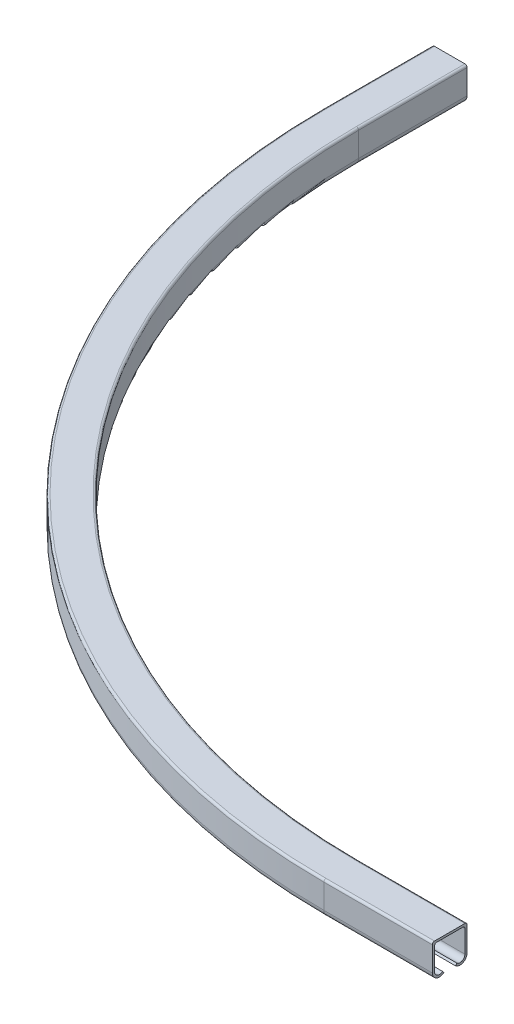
ISO-10303-21;
HEADER;
FILE_DESCRIPTION(('STEP AP214'),'2;1');
FILE_NAME('part.step','',(''),(''),'','','');
FILE_SCHEMA(('AUTOMOTIVE_DESIGN { 1 0 10303 214 1 1 1 1 }'));
ENDSEC;
DATA;
#1=APPLICATION_CONTEXT('core data for automotive mechanical design processes');
#2=APPLICATION_PROTOCOL_DEFINITION('international standard','automotive_design',2000,#1);
#3=PRODUCT_CONTEXT('',#1,'mechanical');
#4=PRODUCT('Part','Part','',(#3));
#5=PRODUCT_RELATED_PRODUCT_CATEGORY('part','',(#4));
#6=PRODUCT_DEFINITION_FORMATION('','',#4);
#7=PRODUCT_DEFINITION_CONTEXT('part definition',#1,'design');
#8=PRODUCT_DEFINITION('design','',#6,#7);
#9=PRODUCT_DEFINITION_SHAPE('','',#8);
#10=(LENGTH_UNIT() NAMED_UNIT(*) SI_UNIT(.MILLI.,.METRE.));
#11=(NAMED_UNIT(*) PLANE_ANGLE_UNIT() SI_UNIT($,.RADIAN.));
#12=(NAMED_UNIT(*) SI_UNIT($,.STERADIAN.) SOLID_ANGLE_UNIT());
#13=UNCERTAINTY_MEASURE_WITH_UNIT(LENGTH_MEASURE(1.E-05),#10,'distance_accuracy_value','');
#14=(GEOMETRIC_REPRESENTATION_CONTEXT(3) GLOBAL_UNCERTAINTY_ASSIGNED_CONTEXT((#13)) GLOBAL_UNIT_ASSIGNED_CONTEXT((#10,
#11,#12)) REPRESENTATION_CONTEXT('',''));
#15=CARTESIAN_POINT('',(0.,0.,0.));
#16=DIRECTION('',(0.,0.,1.));
#17=DIRECTION('',(1.,0.,0.));
#18=AXIS2_PLACEMENT_3D('',#15,#16,#17);
#19=CARTESIAN_POINT('',(600.,-24.5,609.5));
#20=DIRECTION('',(1.,0.,0.));
#21=DIRECTION('',(0.,0.,-1.));
#22=AXIS2_PLACEMENT_3D('',#19,#20,#21);
#23=CYLINDRICAL_SURFACE('',#22,6.5);
#24=CARTESIAN_POINT('',(600.,-24.5,609.5));
#25=DIRECTION('',(1.,0.,0.));
#26=DIRECTION('',(0.,0.,-1.));
#27=AXIS2_PLACEMENT_3D('',#24,#25,#26);
#28=CIRCLE('',#27,6.5);
#29=CARTESIAN_POINT('',(600.,-24.5,616.));
#30=VERTEX_POINT('',#29);
#31=CARTESIAN_POINT('',(600.,-29.460846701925,605.3));
#32=VERTEX_POINT('',#31);
#33=EDGE_CURVE('E268',#30,#32,#28,.T.);
#34=ORIENTED_EDGE('',*,*,#33,.T.);
#35=DIRECTION('',(1.,0.,0.));
#36=VECTOR('',#35,1.);
#37=CARTESIAN_POINT('',(600.,-29.460846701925,605.3));
#38=LINE('',#37,#36);
#39=CARTESIAN_POINT('',(700.,-29.460846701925,605.3));
#40=VERTEX_POINT('',#39);
#41=EDGE_CURVE('E385',#32,#40,#38,.T.);
#42=ORIENTED_EDGE('',*,*,#41,.T.);
#43=CARTESIAN_POINT('',(700.,-24.5,609.5));
#44=DIRECTION('',(1.,0.,0.));
#45=DIRECTION('',(0.,0.,-1.));
#46=AXIS2_PLACEMENT_3D('',#43,#44,#45);
#47=CIRCLE('',#46,6.5);
#48=CARTESIAN_POINT('',(700.,-24.5,616.));
#49=VERTEX_POINT('',#48);
#50=EDGE_CURVE('E364',#49,#40,#47,.T.);
#51=ORIENTED_EDGE('',*,*,#50,.F.);
#52=DIRECTION('',(1.,0.,0.));
#53=VECTOR('',#52,1.);
#54=CARTESIAN_POINT('',(600.,-24.5,616.));
#55=LINE('',#54,#53);
#56=EDGE_CURVE('E388',#30,#49,#55,.T.);
#57=ORIENTED_EDGE('',*,*,#56,.F.);
#58=EDGE_LOOP('',(#34,#42,#51,#57));
#59=FACE_BOUND('',#58,.T.);
#60=ADVANCED_FACE('F33',(#59),#23,.T.);
#61=CARTESIAN_POINT('',(600.,-27.9344323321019,606.592307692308));
#62=DIRECTION('',(0.,0.646153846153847,-0.763207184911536));
#63=DIRECTION('',(0.,0.763207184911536,0.646153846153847));
#64=AXIS2_PLACEMENT_3D('',#61,#62,#63);
#65=PLANE('',#64);
#66=DIRECTION('',(0.,0.763207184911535,0.646153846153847));
#67=VECTOR('',#66,1.);
#68=CARTESIAN_POINT('',(600.,-27.9344323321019,606.592307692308));
#69=LINE('',#68,#67);
#70=CARTESIAN_POINT('',(600.,-27.9344323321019,606.592307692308));
#71=VERTEX_POINT('',#70);
#72=EDGE_CURVE('E311',#32,#71,#69,.T.);
#73=ORIENTED_EDGE('',*,*,#72,.T.);
#74=DIRECTION('',(1.,0.,0.));
#75=VECTOR('',#74,1.);
#76=CARTESIAN_POINT('',(600.,-27.9344323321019,606.592307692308));
#77=LINE('',#76,#75);
#78=CARTESIAN_POINT('',(700.,-27.9344323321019,606.592307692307));
#79=VERTEX_POINT('',#78);
#80=EDGE_CURVE('E382',#71,#79,#77,.T.);
#81=ORIENTED_EDGE('',*,*,#80,.T.);
#82=DIRECTION('',(0.,0.763207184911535,0.646153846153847));
#83=VECTOR('',#82,1.);
#84=CARTESIAN_POINT('',(700.,-27.9344323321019,606.592307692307));
#85=LINE('',#84,#83);
#86=EDGE_CURVE('E361',#40,#79,#85,.T.);
#87=ORIENTED_EDGE('',*,*,#86,.F.);
#88=ORIENTED_EDGE('',*,*,#41,.F.);
#89=EDGE_LOOP('',(#73,#81,#87,#88));
#90=FACE_BOUND('',#89,.T.);
#91=ADVANCED_FACE('F655',(#90),#65,.T.);
#92=CARTESIAN_POINT('',(600.,-24.5,609.5));
#93=DIRECTION('',(1.,0.,0.));
#94=DIRECTION('',(0.,0.,-1.));
#95=AXIS2_PLACEMENT_3D('',#92,#93,#94);
#96=CYLINDRICAL_SURFACE('',#95,4.5);
#97=CARTESIAN_POINT('',(600.,-24.5,609.5));
#98=DIRECTION('',(-1.,0.,0.));
#99=DIRECTION('',(0.,0.,-1.));
#100=AXIS2_PLACEMENT_3D('',#97,#98,#99);
#101=CIRCLE('',#100,4.5);
#102=CARTESIAN_POINT('',(600.,-24.5,614.));
#103=VERTEX_POINT('',#102);
#104=EDGE_CURVE('E308',#71,#103,#101,.T.);
#105=ORIENTED_EDGE('',*,*,#104,.T.);
#106=DIRECTION('',(1.,0.,0.));
#107=VECTOR('',#106,1.);
#108=CARTESIAN_POINT('',(600.,-24.5,614.));
#109=LINE('',#108,#107);
#110=CARTESIAN_POINT('',(700.,-24.5,614.));
#111=VERTEX_POINT('',#110);
#112=EDGE_CURVE('E379',#103,#111,#109,.T.);
#113=ORIENTED_EDGE('',*,*,#112,.T.);
#114=CARTESIAN_POINT('',(700.,-24.5,609.5));
#115=DIRECTION('',(-1.,0.,0.));
#116=DIRECTION('',(0.,0.,-1.));
#117=AXIS2_PLACEMENT_3D('',#114,#115,#116);
#118=CIRCLE('',#117,4.5);
#119=EDGE_CURVE('E358',#79,#111,#118,.T.);
#120=ORIENTED_EDGE('',*,*,#119,.F.);
#121=ORIENTED_EDGE('',*,*,#80,.F.);
#122=EDGE_LOOP('',(#105,#113,#120,#121));
#123=FACE_BOUND('',#122,.T.);
#124=ADVANCED_FACE('F658',(#123),#96,.F.);
#125=CARTESIAN_POINT('',(600.,-2.,614.));
#126=DIRECTION('',(0.,0.,-1.));
#127=DIRECTION('',(-1.,0.,0.));
#128=AXIS2_PLACEMENT_3D('',#125,#126,#127);
#129=PLANE('',#128);
#130=DIRECTION('',(0.,1.,0.));
#131=VECTOR('',#130,1.);
#132=CARTESIAN_POINT('',(600.,-2.,614.));
#133=LINE('',#132,#131);
#134=CARTESIAN_POINT('',(600.,-4.,614.));
#135=VERTEX_POINT('',#134);
#136=EDGE_CURVE('E305',#103,#135,#133,.T.);
#137=ORIENTED_EDGE('',*,*,#136,.T.);
#138=DIRECTION('',(1.,0.,0.));
#139=VECTOR('',#138,1.);
#140=CARTESIAN_POINT('',(600.,-4.,614.));
#141=LINE('',#140,#139);
#142=CARTESIAN_POINT('',(700.,-4.,614.));
#143=VERTEX_POINT('',#142);
#144=EDGE_CURVE('E406',#135,#143,#141,.T.);
#145=ORIENTED_EDGE('',*,*,#144,.T.);
#146=DIRECTION('',(0.,1.,0.));
#147=VECTOR('',#146,1.);
#148=CARTESIAN_POINT('',(700.,-2.,614.));
#149=LINE('',#148,#147);
#150=EDGE_CURVE('E355',#111,#143,#149,.T.);
#151=ORIENTED_EDGE('',*,*,#150,.F.);
#152=ORIENTED_EDGE('',*,*,#112,.F.);
#153=EDGE_LOOP('',(#137,#145,#151,#152));
#154=FACE_BOUND('',#153,.T.);
#155=ADVANCED_FACE('F584',(#154),#129,.T.);
#156=CARTESIAN_POINT('',(600.,-2.,586.));
#157=DIRECTION('',(0.,0.,1.));
#158=DIRECTION('',(1.,0.,0.));
#159=AXIS2_PLACEMENT_3D('',#156,#157,#158);
#160=PLANE('',#159);
#161=DIRECTION('',(0.,-1.,0.));
#162=VECTOR('',#161,1.);
#163=CARTESIAN_POINT('',(700.,-2.,586.));
#164=LINE('',#163,#162);
#165=CARTESIAN_POINT('',(700.,-4.,586.));
#166=VERTEX_POINT('',#165);
#167=CARTESIAN_POINT('',(700.,-24.5,586.));
#168=VERTEX_POINT('',#167);
#169=EDGE_CURVE('E350',#166,#168,#164,.T.);
#170=ORIENTED_EDGE('',*,*,#169,.F.);
#171=DIRECTION('',(1.,0.,0.));
#172=VECTOR('',#171,1.);
#173=CARTESIAN_POINT('',(600.,-4.,586.));
#174=LINE('',#173,#172);
#175=CARTESIAN_POINT('',(600.,-4.,586.));
#176=VERTEX_POINT('',#175);
#177=EDGE_CURVE('E411',#166,#176,#174,.F.);
#178=ORIENTED_EDGE('',*,*,#177,.T.);
#179=DIRECTION('',(0.,-1.,0.));
#180=VECTOR('',#179,1.);
#181=CARTESIAN_POINT('',(600.,-2.,586.));
#182=LINE('',#181,#180);
#183=CARTESIAN_POINT('',(600.,-24.5,586.));
#184=VERTEX_POINT('',#183);
#185=EDGE_CURVE('E303',#176,#184,#182,.T.);
#186=ORIENTED_EDGE('',*,*,#185,.T.);
#187=DIRECTION('',(1.,0.,0.));
#188=VECTOR('',#187,1.);
#189=CARTESIAN_POINT('',(600.,-24.5,586.));
#190=LINE('',#189,#188);
#191=EDGE_CURVE('E376',#184,#168,#190,.T.);
#192=ORIENTED_EDGE('',*,*,#191,.T.);
#193=EDGE_LOOP('',(#170,#178,#186,#192));
#194=FACE_BOUND('',#193,.T.);
#195=ADVANCED_FACE('F913',(#194),#160,.T.);
#196=CARTESIAN_POINT('',(600.,-24.5,590.5));
#197=DIRECTION('',(1.,0.,0.));
#198=DIRECTION('',(0.,0.,-1.));
#199=AXIS2_PLACEMENT_3D('',#196,#197,#198);
#200=CYLINDRICAL_SURFACE('',#199,4.5);
#201=CARTESIAN_POINT('',(600.,-24.5,590.5));
#202=DIRECTION('',(-1.,0.,0.));
#203=DIRECTION('',(0.,0.,1.));
#204=AXIS2_PLACEMENT_3D('',#201,#202,#203);
#205=CIRCLE('',#204,4.5);
#206=CARTESIAN_POINT('',(600.,-27.9344323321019,593.407692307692));
#207=VERTEX_POINT('',#206);
#208=EDGE_CURVE('E300',#184,#207,#205,.T.);
#209=ORIENTED_EDGE('',*,*,#208,.T.);
#210=DIRECTION('',(1.,0.,0.));
#211=VECTOR('',#210,1.);
#212=CARTESIAN_POINT('',(600.,-27.9344323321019,593.407692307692));
#213=LINE('',#212,#211);
#214=CARTESIAN_POINT('',(700.,-27.9344323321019,593.407692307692));
#215=VERTEX_POINT('',#214);
#216=EDGE_CURVE('E373',#207,#215,#213,.T.);
#217=ORIENTED_EDGE('',*,*,#216,.T.);
#218=CARTESIAN_POINT('',(700.,-24.5,590.5));
#219=DIRECTION('',(-1.,0.,0.));
#220=DIRECTION('',(0.,0.,1.));
#221=AXIS2_PLACEMENT_3D('',#218,#219,#220);
#222=CIRCLE('',#221,4.5);
#223=EDGE_CURVE('E347',#168,#215,#222,.T.);
#224=ORIENTED_EDGE('',*,*,#223,.F.);
#225=ORIENTED_EDGE('',*,*,#191,.F.);
#226=EDGE_LOOP('',(#209,#217,#224,#225));
#227=FACE_BOUND('',#226,.T.);
#228=ADVANCED_FACE('F903',(#227),#200,.F.);
#229=CARTESIAN_POINT('',(600.,-27.9344323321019,593.407692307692));
#230=DIRECTION('',(0.,0.646153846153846,0.763207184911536));
#231=DIRECTION('',(0.,-0.763207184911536,0.646153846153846));
#232=AXIS2_PLACEMENT_3D('',#229,#230,#231);
#233=PLANE('',#232);
#234=DIRECTION('',(0.,-0.763207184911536,0.646153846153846));
#235=VECTOR('',#234,1.);
#236=CARTESIAN_POINT('',(600.,-27.9344323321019,593.407692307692));
#237=LINE('',#236,#235);
#238=CARTESIAN_POINT('',(600.,-29.460846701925,594.7));
#239=VERTEX_POINT('',#238);
#240=EDGE_CURVE('E297',#207,#239,#237,.T.);
#241=ORIENTED_EDGE('',*,*,#240,.T.);
#242=DIRECTION('',(1.,0.,0.));
#243=VECTOR('',#242,1.);
#244=CARTESIAN_POINT('',(600.,-29.460846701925,594.7));
#245=LINE('',#244,#243);
#246=CARTESIAN_POINT('',(700.,-29.460846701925,594.7));
#247=VERTEX_POINT('',#246);
#248=EDGE_CURVE('E370',#239,#247,#245,.T.);
#249=ORIENTED_EDGE('',*,*,#248,.T.);
#250=DIRECTION('',(0.,-0.763207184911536,0.646153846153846));
#251=VECTOR('',#250,1.);
#252=CARTESIAN_POINT('',(700.,-27.9344323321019,593.407692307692));
#253=LINE('',#252,#251);
#254=EDGE_CURVE('E344',#215,#247,#253,.T.);
#255=ORIENTED_EDGE('',*,*,#254,.F.);
#256=ORIENTED_EDGE('',*,*,#216,.F.);
#257=EDGE_LOOP('',(#241,#249,#255,#256));
#258=FACE_BOUND('',#257,.T.);
#259=ADVANCED_FACE('F892',(#258),#233,.T.);
#260=CARTESIAN_POINT('',(600.,-24.5,590.5));
#261=DIRECTION('',(1.,0.,0.));
#262=DIRECTION('',(0.,0.,-1.));
#263=AXIS2_PLACEMENT_3D('',#260,#261,#262);
#264=CYLINDRICAL_SURFACE('',#263,6.5);
#265=CARTESIAN_POINT('',(600.,-24.5,590.5));
#266=DIRECTION('',(1.,0.,0.));
#267=DIRECTION('',(0.,0.,1.));
#268=AXIS2_PLACEMENT_3D('',#265,#266,#267);
#269=CIRCLE('',#268,6.5);
#270=CARTESIAN_POINT('',(600.,-24.5,584.));
#271=VERTEX_POINT('',#270);
#272=EDGE_CURVE('E294',#239,#271,#269,.T.);
#273=ORIENTED_EDGE('',*,*,#272,.T.);
#274=DIRECTION('',(1.,0.,0.));
#275=VECTOR('',#274,1.);
#276=CARTESIAN_POINT('',(600.,-24.5,584.));
#277=LINE('',#276,#275);
#278=CARTESIAN_POINT('',(700.,-24.5,584.));
#279=VERTEX_POINT('',#278);
#280=EDGE_CURVE('E367',#271,#279,#277,.T.);
#281=ORIENTED_EDGE('',*,*,#280,.T.);
#282=CARTESIAN_POINT('',(700.,-24.5,590.5));
#283=DIRECTION('',(1.,0.,0.));
#284=DIRECTION('',(0.,0.,1.));
#285=AXIS2_PLACEMENT_3D('',#282,#283,#284);
#286=CIRCLE('',#285,6.5);
#287=EDGE_CURVE('E341',#247,#279,#286,.T.);
#288=ORIENTED_EDGE('',*,*,#287,.F.);
#289=ORIENTED_EDGE('',*,*,#248,.F.);
#290=EDGE_LOOP('',(#273,#281,#288,#289));
#291=FACE_BOUND('',#290,.T.);
#292=ADVANCED_FACE('F489',(#291),#264,.T.);
#293=CARTESIAN_POINT('',(600.,0.,584.));
#294=DIRECTION('',(0.,0.,-1.));
#295=DIRECTION('',(-1.,0.,0.));
#296=AXIS2_PLACEMENT_3D('',#293,#294,#295);
#297=PLANE('',#296);
#298=DIRECTION('',(0.,1.,0.));
#299=VECTOR('',#298,1.);
#300=CARTESIAN_POINT('',(600.,0.,584.));
#301=LINE('',#300,#299);
#302=CARTESIAN_POINT('',(600.,-2.,584.));
#303=VERTEX_POINT('',#302);
#304=EDGE_CURVE('E287',#271,#303,#301,.T.);
#305=ORIENTED_EDGE('',*,*,#304,.T.);
#306=DIRECTION('',(1.,0.,0.));
#307=VECTOR('',#306,1.);
#308=CARTESIAN_POINT('',(700.,-2.,584.));
#309=LINE('',#308,#307);
#310=CARTESIAN_POINT('',(700.,-2.,584.));
#311=VERTEX_POINT('',#310);
#312=EDGE_CURVE('E439',#303,#311,#309,.T.);
#313=ORIENTED_EDGE('',*,*,#312,.T.);
#314=DIRECTION('',(0.,1.,0.));
#315=VECTOR('',#314,1.);
#316=CARTESIAN_POINT('',(700.,0.,584.));
#317=LINE('',#316,#315);
#318=EDGE_CURVE('E338',#279,#311,#317,.T.);
#319=ORIENTED_EDGE('',*,*,#318,.F.);
#320=ORIENTED_EDGE('',*,*,#280,.F.);
#321=EDGE_LOOP('',(#305,#313,#319,#320));
#322=FACE_BOUND('',#321,.T.);
#323=ADVANCED_FACE('F484',(#322),#297,.T.);
#324=CARTESIAN_POINT('',(600.,0.,616.));
#325=DIRECTION('',(0.,0.,1.));
#326=DIRECTION('',(1.,0.,0.));
#327=AXIS2_PLACEMENT_3D('',#324,#325,#326);
#328=PLANE('',#327);
#329=DIRECTION('',(0.,-1.,0.));
#330=VECTOR('',#329,1.);
#331=CARTESIAN_POINT('',(700.,0.,616.));
#332=LINE('',#331,#330);
#333=CARTESIAN_POINT('',(700.,-2.,616.));
#334=VERTEX_POINT('',#333);
#335=EDGE_CURVE('E269',#334,#49,#332,.T.);
#336=ORIENTED_EDGE('',*,*,#335,.F.);
#337=DIRECTION('',(1.,0.,0.));
#338=VECTOR('',#337,1.);
#339=CARTESIAN_POINT('',(600.,-2.,616.));
#340=LINE('',#339,#338);
#341=CARTESIAN_POINT('',(600.,-2.,616.));
#342=VERTEX_POINT('',#341);
#343=EDGE_CURVE('E436',#334,#342,#340,.F.);
#344=ORIENTED_EDGE('',*,*,#343,.T.);
#345=DIRECTION('',(0.,-1.,0.));
#346=VECTOR('',#345,1.);
#347=CARTESIAN_POINT('',(600.,0.,616.));
#348=LINE('',#347,#346);
#349=EDGE_CURVE('E285',#342,#30,#348,.T.);
#350=ORIENTED_EDGE('',*,*,#349,.T.);
#351=ORIENTED_EDGE('',*,*,#56,.T.);
#352=EDGE_LOOP('',(#336,#344,#350,#351));
#353=FACE_BOUND('',#352,.T.);
#354=ADVANCED_FACE('F650',(#353),#328,.T.);
#355=CARTESIAN_POINT('',(600.,-24.5,0.));
#356=DIRECTION('',(0.,1.,0.));
#357=DIRECTION('',(0.,0.,1.));
#358=AXIS2_PLACEMENT_3D('',#355,#356,#357);
#359=TOROIDAL_SURFACE('',#358,609.5,6.5);
#360=CARTESIAN_POINT('',(-9.5,-24.5,0.));
#361=DIRECTION('',(0.,0.,1.));
#362=DIRECTION('',(1.,0.,0.));
#363=AXIS2_PLACEMENT_3D('',#360,#361,#362);
#364=CIRCLE('',#363,6.5);
#365=CARTESIAN_POINT('',(-16.,-24.5,0.));
#366=VERTEX_POINT('',#365);
#367=CARTESIAN_POINT('',(-5.3,-29.460846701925,0.));
#368=VERTEX_POINT('',#367);
#369=EDGE_CURVE('E257',#366,#368,#364,.T.);
#370=ORIENTED_EDGE('',*,*,#369,.T.);
#371=CARTESIAN_POINT('',(600.,-29.460846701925,0.));
#372=DIRECTION('',(0.,1.,0.));
#373=DIRECTION('',(0.,0.,1.));
#374=AXIS2_PLACEMENT_3D('',#371,#372,#373);
#375=CIRCLE('',#374,605.3);
#376=EDGE_CURVE('E270',#368,#32,#375,.T.);
#377=ORIENTED_EDGE('',*,*,#376,.T.);
#378=ORIENTED_EDGE('',*,*,#33,.F.);
#379=CARTESIAN_POINT('',(600.,-24.5,0.));
#380=DIRECTION('',(0.,1.,0.));
#381=DIRECTION('',(0.,0.,1.));
#382=AXIS2_PLACEMENT_3D('',#379,#380,#381);
#383=CIRCLE('',#382,616.);
#384=EDGE_CURVE('E250',#366,#30,#383,.T.);
#385=ORIENTED_EDGE('',*,*,#384,.F.);
#386=EDGE_LOOP('',(#370,#377,#378,#385));
#387=FACE_BOUND('',#386,.T.);
#388=ADVANCED_FACE('F264',(#387),#359,.T.);
#389=CARTESIAN_POINT('',(600.,-29.460846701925,0.));
#390=DIRECTION('',(0.,1.,0.));
#391=DIRECTION('',(0.,0.,1.));
#392=AXIS2_PLACEMENT_3D('',#389,#390,#391);
#393=CONICAL_SURFACE('',#392,605.3,0.702534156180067);
#394=DIRECTION('',(-0.646153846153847,0.763207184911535,0.));
#395=VECTOR('',#394,1.);
#396=CARTESIAN_POINT('',(-6.59230769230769,-27.9344323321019,0.));
#397=LINE('',#396,#395);
#398=CARTESIAN_POINT('',(-6.59230769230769,-27.9344323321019,0.));
#399=VERTEX_POINT('',#398);
#400=EDGE_CURVE('E279',#368,#399,#397,.T.);
#401=ORIENTED_EDGE('',*,*,#400,.T.);
#402=CARTESIAN_POINT('',(600.,-27.9344323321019,0.));
#403=DIRECTION('',(0.,1.,0.));
#404=DIRECTION('',(0.,0.,1.));
#405=AXIS2_PLACEMENT_3D('',#402,#403,#404);
#406=CIRCLE('',#405,606.592307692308);
#407=EDGE_CURVE('E330',#399,#71,#406,.T.);
#408=ORIENTED_EDGE('',*,*,#407,.T.);
#409=ORIENTED_EDGE('',*,*,#72,.F.);
#410=ORIENTED_EDGE('',*,*,#376,.F.);
#411=EDGE_LOOP('',(#401,#408,#409,#410));
#412=FACE_BOUND('',#411,.T.);
#413=ADVANCED_FACE('F663',(#412),#393,.F.);
#414=CARTESIAN_POINT('',(600.,-24.5,0.));
#415=DIRECTION('',(0.,1.,0.));
#416=DIRECTION('',(0.,0.,1.));
#417=AXIS2_PLACEMENT_3D('',#414,#415,#416);
#418=TOROIDAL_SURFACE('',#417,609.5,4.5);
#419=CARTESIAN_POINT('',(-9.5,-24.5,0.));
#420=DIRECTION('',(0.,0.,-1.));
#421=DIRECTION('',(1.,0.,0.));
#422=AXIS2_PLACEMENT_3D('',#419,#420,#421);
#423=CIRCLE('',#422,4.5);
#424=CARTESIAN_POINT('',(-14.,-24.5,0.));
#425=VERTEX_POINT('',#424);
#426=EDGE_CURVE('E557',#399,#425,#423,.T.);
#427=ORIENTED_EDGE('',*,*,#426,.T.);
#428=CARTESIAN_POINT('',(600.,-24.5,0.));
#429=DIRECTION('',(0.,1.,0.));
#430=DIRECTION('',(0.,0.,1.));
#431=AXIS2_PLACEMENT_3D('',#428,#429,#430);
#432=CIRCLE('',#431,614.);
#433=EDGE_CURVE('E327',#425,#103,#432,.T.);
#434=ORIENTED_EDGE('',*,*,#433,.T.);
#435=ORIENTED_EDGE('',*,*,#104,.F.);
#436=ORIENTED_EDGE('',*,*,#407,.F.);
#437=EDGE_LOOP('',(#427,#434,#435,#436));
#438=FACE_BOUND('',#437,.T.);
#439=ADVANCED_FACE('F660',(#438),#418,.F.);
#440=CARTESIAN_POINT('',(600.,0.,0.));
#441=DIRECTION('',(0.,1.,0.));
#442=DIRECTION('',(0.,0.,1.));
#443=AXIS2_PLACEMENT_3D('',#440,#441,#442);
#444=CYLINDRICAL_SURFACE('',#443,614.);
#445=DIRECTION('',(0.,1.,0.));
#446=VECTOR('',#445,1.);
#447=CARTESIAN_POINT('',(-14.,-2.,0.));
#448=LINE('',#447,#446);
#449=CARTESIAN_POINT('',(-14.,-4.,0.));
#450=VERTEX_POINT('',#449);
#451=EDGE_CURVE('E581',#425,#450,#448,.T.);
#452=ORIENTED_EDGE('',*,*,#451,.T.);
#453=CARTESIAN_POINT('',(600.,-4.,0.));
#454=DIRECTION('',(0.,1.,0.));
#455=DIRECTION('',(0.,0.,1.));
#456=AXIS2_PLACEMENT_3D('',#453,#454,#455);
#457=CIRCLE('',#456,614.);
#458=EDGE_CURVE('E441',#450,#135,#457,.T.);
#459=ORIENTED_EDGE('',*,*,#458,.T.);
#460=ORIENTED_EDGE('',*,*,#136,.F.);
#461=ORIENTED_EDGE('',*,*,#433,.F.);
#462=EDGE_LOOP('',(#452,#459,#460,#461));
#463=FACE_BOUND('',#462,.T.);
#464=ADVANCED_FACE('F580',(#463),#444,.F.);
#465=CARTESIAN_POINT('',(600.,0.,0.));
#466=DIRECTION('',(0.,1.,0.));
#467=DIRECTION('',(0.,0.,1.));
#468=AXIS2_PLACEMENT_3D('',#465,#466,#467);
#469=CYLINDRICAL_SURFACE('',#468,586.);
#470=ORIENTED_EDGE('',*,*,#185,.F.);
#471=CARTESIAN_POINT('',(600.,-4.,0.));
#472=DIRECTION('',(0.,1.,0.));
#473=DIRECTION('',(0.,0.,1.));
#474=AXIS2_PLACEMENT_3D('',#471,#472,#473);
#475=CIRCLE('',#474,586.);
#476=CARTESIAN_POINT('',(14.,-4.,0.));
#477=VERTEX_POINT('',#476);
#478=EDGE_CURVE('E443',#176,#477,#475,.F.);
#479=ORIENTED_EDGE('',*,*,#478,.T.);
#480=DIRECTION('',(0.,-1.,0.));
#481=VECTOR('',#480,1.);
#482=CARTESIAN_POINT('',(14.,-2.,0.));
#483=LINE('',#482,#481);
#484=CARTESIAN_POINT('',(14.,-24.5,0.));
#485=VERTEX_POINT('',#484);
#486=EDGE_CURVE('E608',#477,#485,#483,.T.);
#487=ORIENTED_EDGE('',*,*,#486,.T.);
#488=CARTESIAN_POINT('',(600.,-24.5,0.));
#489=DIRECTION('',(0.,1.,0.));
#490=DIRECTION('',(0.,0.,1.));
#491=AXIS2_PLACEMENT_3D('',#488,#489,#490);
#492=CIRCLE('',#491,586.);
#493=EDGE_CURVE('E324',#485,#184,#492,.T.);
#494=ORIENTED_EDGE('',*,*,#493,.T.);
#495=EDGE_LOOP('',(#470,#479,#487,#494));
#496=FACE_BOUND('',#495,.T.);
#497=ADVANCED_FACE('F607',(#496),#469,.T.);
#498=CARTESIAN_POINT('',(600.,-24.5,0.));
#499=DIRECTION('',(0.,1.,0.));
#500=DIRECTION('',(0.,0.,1.));
#501=AXIS2_PLACEMENT_3D('',#498,#499,#500);
#502=TOROIDAL_SURFACE('',#501,590.5,4.5);
#503=CARTESIAN_POINT('',(9.5,-24.5,0.));
#504=DIRECTION('',(0.,0.,-1.));
#505=DIRECTION('',(-1.,0.,0.));
#506=AXIS2_PLACEMENT_3D('',#503,#504,#505);
#507=CIRCLE('',#506,4.5);
#508=CARTESIAN_POINT('',(6.59230769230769,-27.9344323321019,0.));
#509=VERTEX_POINT('',#508);
#510=EDGE_CURVE('E615',#485,#509,#507,.T.);
#511=ORIENTED_EDGE('',*,*,#510,.T.);
#512=CARTESIAN_POINT('',(600.,-27.9344323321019,0.));
#513=DIRECTION('',(0.,1.,0.));
#514=DIRECTION('',(0.,0.,1.));
#515=AXIS2_PLACEMENT_3D('',#512,#513,#514);
#516=CIRCLE('',#515,593.407692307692);
#517=EDGE_CURVE('E321',#509,#207,#516,.T.);
#518=ORIENTED_EDGE('',*,*,#517,.T.);
#519=ORIENTED_EDGE('',*,*,#208,.F.);
#520=ORIENTED_EDGE('',*,*,#493,.F.);
#521=EDGE_LOOP('',(#511,#518,#519,#520));
#522=FACE_BOUND('',#521,.T.);
#523=ADVANCED_FACE('F844',(#522),#502,.F.);
#524=CARTESIAN_POINT('',(600.,-27.9344323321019,0.));
#525=DIRECTION('',(0.,-1.,0.));
#526=DIRECTION('',(0.,0.,-1.));
#527=AXIS2_PLACEMENT_3D('',#524,#525,#526);
#528=CONICAL_SURFACE('',#527,593.407692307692,0.702534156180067);
#529=DIRECTION('',(-0.646153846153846,-0.763207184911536,0.));
#530=VECTOR('',#529,1.);
#531=CARTESIAN_POINT('',(6.59230769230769,-27.9344323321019,0.));
#532=LINE('',#531,#530);
#533=CARTESIAN_POINT('',(5.3,-29.460846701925,0.));
#534=VERTEX_POINT('',#533);
#535=EDGE_CURVE('E502',#509,#534,#532,.T.);
#536=ORIENTED_EDGE('',*,*,#535,.T.);
#537=CARTESIAN_POINT('',(600.,-29.460846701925,0.));
#538=DIRECTION('',(0.,1.,0.));
#539=DIRECTION('',(0.,0.,1.));
#540=AXIS2_PLACEMENT_3D('',#537,#538,#539);
#541=CIRCLE('',#540,594.7);
#542=EDGE_CURVE('E318',#534,#239,#541,.T.);
#543=ORIENTED_EDGE('',*,*,#542,.T.);
#544=ORIENTED_EDGE('',*,*,#240,.F.);
#545=ORIENTED_EDGE('',*,*,#517,.F.);
#546=EDGE_LOOP('',(#536,#543,#544,#545));
#547=FACE_BOUND('',#546,.T.);
#548=ADVANCED_FACE('F624',(#547),#528,.T.);
#549=CARTESIAN_POINT('',(600.,-24.5,0.));
#550=DIRECTION('',(0.,1.,0.));
#551=DIRECTION('',(0.,0.,1.));
#552=AXIS2_PLACEMENT_3D('',#549,#550,#551);
#553=TOROIDAL_SURFACE('',#552,590.5,6.5);
#554=CARTESIAN_POINT('',(9.5,-24.5,0.));
#555=DIRECTION('',(0.,0.,1.));
#556=DIRECTION('',(-1.,0.,0.));
#557=AXIS2_PLACEMENT_3D('',#554,#555,#556);
#558=CIRCLE('',#557,6.5);
#559=CARTESIAN_POINT('',(16.,-24.5,0.));
#560=VERTEX_POINT('',#559);
#561=EDGE_CURVE('E496',#534,#560,#558,.T.);
#562=ORIENTED_EDGE('',*,*,#561,.T.);
#563=CARTESIAN_POINT('',(600.,-24.5,0.));
#564=DIRECTION('',(0.,1.,0.));
#565=DIRECTION('',(0.,0.,1.));
#566=AXIS2_PLACEMENT_3D('',#563,#564,#565);
#567=CIRCLE('',#566,584.);
#568=EDGE_CURVE('E315',#560,#271,#567,.T.);
#569=ORIENTED_EDGE('',*,*,#568,.T.);
#570=ORIENTED_EDGE('',*,*,#272,.F.);
#571=ORIENTED_EDGE('',*,*,#542,.F.);
#572=EDGE_LOOP('',(#562,#569,#570,#571));
#573=FACE_BOUND('',#572,.T.);
#574=ADVANCED_FACE('F494',(#573),#553,.T.);
#575=CARTESIAN_POINT('',(600.,0.,0.));
#576=DIRECTION('',(0.,1.,0.));
#577=DIRECTION('',(0.,0.,1.));
#578=AXIS2_PLACEMENT_3D('',#575,#576,#577);
#579=CYLINDRICAL_SURFACE('',#578,584.);
#580=DIRECTION('',(0.,1.,0.));
#581=VECTOR('',#580,1.);
#582=CARTESIAN_POINT('',(16.,0.,0.));
#583=LINE('',#582,#581);
#584=CARTESIAN_POINT('',(16.,-2.,0.));
#585=VERTEX_POINT('',#584);
#586=EDGE_CURVE('E501',#560,#585,#583,.T.);
#587=ORIENTED_EDGE('',*,*,#586,.T.);
#588=CARTESIAN_POINT('',(600.,-2.,0.));
#589=DIRECTION('',(0.,-1.,0.));
#590=DIRECTION('',(0.,0.,-1.));
#591=AXIS2_PLACEMENT_3D('',#588,#589,#590);
#592=CIRCLE('',#591,584.);
#593=EDGE_CURVE('E50',#585,#303,#592,.F.);
#594=ORIENTED_EDGE('',*,*,#593,.T.);
#595=ORIENTED_EDGE('',*,*,#304,.F.);
#596=ORIENTED_EDGE('',*,*,#568,.F.);
#597=EDGE_LOOP('',(#587,#594,#595,#596));
#598=FACE_BOUND('',#597,.T.);
#599=ADVANCED_FACE('F492',(#598),#579,.F.);
#600=CARTESIAN_POINT('',(600.,0.,0.));
#601=DIRECTION('',(0.,1.,0.));
#602=DIRECTION('',(0.,0.,1.));
#603=AXIS2_PLACEMENT_3D('',#600,#601,#602);
#604=CYLINDRICAL_SURFACE('',#603,616.);
#605=ORIENTED_EDGE('',*,*,#349,.F.);
#606=CARTESIAN_POINT('',(600.,-2.,0.));
#607=DIRECTION('',(0.,-1.,0.));
#608=DIRECTION('',(0.,0.,-1.));
#609=AXIS2_PLACEMENT_3D('',#606,#607,#608);
#610=CIRCLE('',#609,616.);
#611=CARTESIAN_POINT('',(-16.,-2.,0.));
#612=VERTEX_POINT('',#611);
#613=EDGE_CURVE('E252',#342,#612,#610,.T.);
#614=ORIENTED_EDGE('',*,*,#613,.T.);
#615=DIRECTION('',(0.,-1.,0.));
#616=VECTOR('',#615,1.);
#617=CARTESIAN_POINT('',(-16.,0.,0.));
#618=LINE('',#617,#616);
#619=EDGE_CURVE('E246',#612,#366,#618,.T.);
#620=ORIENTED_EDGE('',*,*,#619,.T.);
#621=ORIENTED_EDGE('',*,*,#384,.T.);
#622=EDGE_LOOP('',(#605,#614,#620,#621));
#623=FACE_BOUND('',#622,.T.);
#624=ADVANCED_FACE('F249',(#623),#604,.T.);
#625=CARTESIAN_POINT('',(-16.,0.,0.));
#626=DIRECTION('',(1.,0.,0.));
#627=DIRECTION('',(0.,1.,0.));
#628=AXIS2_PLACEMENT_3D('',#625,#626,#627);
#629=PLANE('',#628);
#630=ORIENTED_EDGE('',*,*,#619,.F.);
#631=DIRECTION('',(0.,0.,-1.));
#632=VECTOR('',#631,1.);
#633=CARTESIAN_POINT('',(-16.,-2.,0.));
#634=LINE('',#633,#632);
#635=CARTESIAN_POINT('',(-16.,-2.,-100.));
#636=VERTEX_POINT('',#635);
#637=EDGE_CURVE('E413',#612,#636,#634,.T.);
#638=ORIENTED_EDGE('',*,*,#637,.T.);
#639=DIRECTION('',(0.,-1.,0.));
#640=VECTOR('',#639,1.);
#641=CARTESIAN_POINT('',(-16.,0.,-100.));
#642=LINE('',#641,#640);
#643=CARTESIAN_POINT('',(-16.,-24.5,-100.));
#644=VERTEX_POINT('',#643);
#645=EDGE_CURVE('E283',#636,#644,#642,.T.);
#646=ORIENTED_EDGE('',*,*,#645,.T.);
#647=DIRECTION('',(0.,0.,-1.));
#648=VECTOR('',#647,1.);
#649=CARTESIAN_POINT('',(-16.,-24.5,0.));
#650=LINE('',#649,#648);
#651=EDGE_CURVE('E275',#366,#644,#650,.T.);
#652=ORIENTED_EDGE('',*,*,#651,.F.);
#653=EDGE_LOOP('',(#630,#638,#646,#652));
#654=FACE_BOUND('',#653,.T.);
#655=ADVANCED_FACE('F281',(#654),#629,.F.);
#656=CARTESIAN_POINT('',(-9.5,-24.5,0.));
#657=DIRECTION('',(0.,0.,-1.));
#658=DIRECTION('',(-1.,0.,0.));
#659=AXIS2_PLACEMENT_3D('',#656,#657,#658);
#660=CYLINDRICAL_SURFACE('',#659,6.5);
#661=CARTESIAN_POINT('',(-9.5,-24.5,-100.));
#662=DIRECTION('',(0.,0.,1.));
#663=DIRECTION('',(1.,0.,0.));
#664=AXIS2_PLACEMENT_3D('',#661,#662,#663);
#665=CIRCLE('',#664,6.5);
#666=CARTESIAN_POINT('',(-5.3,-29.460846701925,-100.));
#667=VERTEX_POINT('',#666);
#668=EDGE_CURVE('E517',#644,#667,#665,.T.);
#669=ORIENTED_EDGE('',*,*,#668,.T.);
#670=DIRECTION('',(0.,0.,-1.));
#671=VECTOR('',#670,1.);
#672=CARTESIAN_POINT('',(-5.3,-29.460846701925,0.));
#673=LINE('',#672,#671);
#674=EDGE_CURVE('E277',#368,#667,#673,.T.);
#675=ORIENTED_EDGE('',*,*,#674,.F.);
#676=ORIENTED_EDGE('',*,*,#369,.F.);
#677=ORIENTED_EDGE('',*,*,#651,.T.);
#678=EDGE_LOOP('',(#669,#675,#676,#677));
#679=FACE_BOUND('',#678,.T.);
#680=ADVANCED_FACE('F274',(#679),#660,.T.);
#681=CARTESIAN_POINT('',(-6.59230769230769,-27.9344323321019,0.));
#682=DIRECTION('',(-0.763207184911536,-0.646153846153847,0.));
#683=DIRECTION('',(0.646153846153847,-0.763207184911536,0.));
#684=AXIS2_PLACEMENT_3D('',#681,#682,#683);
#685=PLANE('',#684);
#686=DIRECTION('',(-0.646153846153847,0.763207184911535,0.));
#687=VECTOR('',#686,1.);
#688=CARTESIAN_POINT('',(-6.59230769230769,-27.9344323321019,-100.));
#689=LINE('',#688,#687);
#690=CARTESIAN_POINT('',(-6.59230769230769,-27.9344323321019,-100.));
#691=VERTEX_POINT('',#690);
#692=EDGE_CURVE('E519',#667,#691,#689,.T.);
#693=ORIENTED_EDGE('',*,*,#692,.T.);
#694=DIRECTION('',(0.,0.,-1.));
#695=VECTOR('',#694,1.);
#696=CARTESIAN_POINT('',(-6.59230769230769,-27.9344323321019,0.));
#697=LINE('',#696,#695);
#698=EDGE_CURVE('E289',#399,#691,#697,.T.);
#699=ORIENTED_EDGE('',*,*,#698,.F.);
#700=ORIENTED_EDGE('',*,*,#400,.F.);
#701=ORIENTED_EDGE('',*,*,#674,.T.);
#702=EDGE_LOOP('',(#693,#699,#700,#701));
#703=FACE_BOUND('',#702,.T.);
#704=ADVANCED_FACE('F665',(#703),#685,.F.);
#705=CARTESIAN_POINT('',(-9.5,-24.5,0.));
#706=DIRECTION('',(0.,0.,-1.));
#707=DIRECTION('',(-1.,0.,0.));
#708=AXIS2_PLACEMENT_3D('',#705,#706,#707);
#709=CYLINDRICAL_SURFACE('',#708,4.5);
#710=CARTESIAN_POINT('',(-9.5,-24.5,-100.));
#711=DIRECTION('',(0.,0.,-1.));
#712=DIRECTION('',(1.,0.,0.));
#713=AXIS2_PLACEMENT_3D('',#710,#711,#712);
#714=CIRCLE('',#713,4.5);
#715=CARTESIAN_POINT('',(-14.,-24.5,-100.));
#716=VERTEX_POINT('',#715);
#717=EDGE_CURVE('E521',#691,#716,#714,.T.);
#718=ORIENTED_EDGE('',*,*,#717,.T.);
#719=DIRECTION('',(0.,0.,-1.));
#720=VECTOR('',#719,1.);
#721=CARTESIAN_POINT('',(-14.,-24.5,0.));
#722=LINE('',#721,#720);
#723=EDGE_CURVE('E547',#425,#716,#722,.T.);
#724=ORIENTED_EDGE('',*,*,#723,.F.);
#725=ORIENTED_EDGE('',*,*,#426,.F.);
#726=ORIENTED_EDGE('',*,*,#698,.T.);
#727=EDGE_LOOP('',(#718,#724,#725,#726));
#728=FACE_BOUND('',#727,.T.);
#729=ADVANCED_FACE('F554',(#728),#709,.F.);
#730=CARTESIAN_POINT('',(-14.,-2.,0.));
#731=DIRECTION('',(-1.,0.,0.));
#732=DIRECTION('',(0.,-1.,0.));
#733=AXIS2_PLACEMENT_3D('',#730,#731,#732);
#734=PLANE('',#733);
#735=DIRECTION('',(0.,1.,0.));
#736=VECTOR('',#735,1.);
#737=CARTESIAN_POINT('',(-14.,-2.,-100.));
#738=LINE('',#737,#736);
#739=CARTESIAN_POINT('',(-14.,-4.,-100.));
#740=VERTEX_POINT('',#739);
#741=EDGE_CURVE('E523',#716,#740,#738,.T.);
#742=ORIENTED_EDGE('',*,*,#741,.T.);
#743=DIRECTION('',(0.,0.,-1.));
#744=VECTOR('',#743,1.);
#745=CARTESIAN_POINT('',(-14.,-4.,0.));
#746=LINE('',#745,#744);
#747=EDGE_CURVE('E404',#740,#450,#746,.F.);
#748=ORIENTED_EDGE('',*,*,#747,.T.);
#749=ORIENTED_EDGE('',*,*,#451,.F.);
#750=ORIENTED_EDGE('',*,*,#723,.T.);
#751=EDGE_LOOP('',(#742,#748,#749,#750));
#752=FACE_BOUND('',#751,.T.);
#753=ADVANCED_FACE('F566',(#752),#734,.F.);
#754=CARTESIAN_POINT('',(0.,-2.,0.));
#755=DIRECTION('',(0.,1.,0.));
#756=DIRECTION('',(0.,0.,1.));
#757=AXIS2_PLACEMENT_3D('',#754,#755,#756);
#758=PLANE('',#757);
#759=CARTESIAN_POINT('',(600.,-2.,0.));
#760=DIRECTION('',(0.,1.,0.));
#761=DIRECTION('',(0.,0.,1.));
#762=AXIS2_PLACEMENT_3D('',#759,#760,#761);
#763=CIRCLE('',#762,612.);
#764=CARTESIAN_POINT('',(600.,-2.,612.));
#765=VERTEX_POINT('',#764);
#766=CARTESIAN_POINT('',(-12.,-2.,0.));
#767=VERTEX_POINT('',#766);
#768=EDGE_CURVE('E397',#765,#767,#763,.F.);
#769=ORIENTED_EDGE('',*,*,#768,.T.);
#770=DIRECTION('',(0.,0.,-1.));
#771=VECTOR('',#770,1.);
#772=CARTESIAN_POINT('',(-12.,-2.,-100.));
#773=LINE('',#772,#771);
#774=CARTESIAN_POINT('',(-12.,-2.,-100.));
#775=VERTEX_POINT('',#774);
#776=EDGE_CURVE('E401',#767,#775,#773,.T.);
#777=ORIENTED_EDGE('',*,*,#776,.T.);
#778=DIRECTION('',(1.,0.,0.));
#779=VECTOR('',#778,1.);
#780=CARTESIAN_POINT('',(0.,-2.,-100.));
#781=LINE('',#780,#779);
#782=CARTESIAN_POINT('',(12.,-2.,-100.));
#783=VERTEX_POINT('',#782);
#784=EDGE_CURVE('E526',#775,#783,#781,.T.);
#785=ORIENTED_EDGE('',*,*,#784,.T.);
#786=DIRECTION('',(0.,0.,-1.));
#787=VECTOR('',#786,1.);
#788=CARTESIAN_POINT('',(12.,-2.,0.));
#789=LINE('',#788,#787);
#790=CARTESIAN_POINT('',(12.,-2.,0.));
#791=VERTEX_POINT('',#790);
#792=EDGE_CURVE('E395',#783,#791,#789,.F.);
#793=ORIENTED_EDGE('',*,*,#792,.T.);
#794=CARTESIAN_POINT('',(600.,-2.,0.));
#795=DIRECTION('',(0.,1.,0.));
#796=DIRECTION('',(0.,0.,1.));
#797=AXIS2_PLACEMENT_3D('',#794,#795,#796);
#798=CIRCLE('',#797,588.);
#799=CARTESIAN_POINT('',(600.,-2.,588.));
#800=VERTEX_POINT('',#799);
#801=EDGE_CURVE('E391',#791,#800,#798,.T.);
#802=ORIENTED_EDGE('',*,*,#801,.T.);
#803=DIRECTION('',(1.,0.,0.));
#804=VECTOR('',#803,1.);
#805=CARTESIAN_POINT('',(1.30562227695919E-12,-2.,588.000000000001));
#806=LINE('',#805,#804);
#807=CARTESIAN_POINT('',(700.,-2.,588.));
#808=VERTEX_POINT('',#807);
#809=EDGE_CURVE('E393',#800,#808,#806,.T.);
#810=ORIENTED_EDGE('',*,*,#809,.T.);
#811=DIRECTION('',(0.,0.,-1.));
#812=VECTOR('',#811,1.);
#813=CARTESIAN_POINT('',(700.,-2.,600.));
#814=LINE('',#813,#812);
#815=CARTESIAN_POINT('',(700.,-2.,612.));
#816=VERTEX_POINT('',#815);
#817=EDGE_CURVE('E352',#816,#808,#814,.T.);
#818=ORIENTED_EDGE('',*,*,#817,.F.);
#819=DIRECTION('',(1.,0.,0.));
#820=VECTOR('',#819,1.);
#821=CARTESIAN_POINT('',(1.35891298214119E-12,-2.,612.000000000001));
#822=LINE('',#821,#820);
#823=EDGE_CURVE('E399',#816,#765,#822,.F.);
#824=ORIENTED_EDGE('',*,*,#823,.T.);
#825=EDGE_LOOP('',(#769,#777,#785,#793,#802,#810,#818,#824));
#826=FACE_BOUND('',#825,.T.);
#827=ADVANCED_FACE('F592',(#826),#758,.F.);
#828=CARTESIAN_POINT('',(14.,-2.,0.));
#829=DIRECTION('',(1.,0.,0.));
#830=DIRECTION('',(0.,1.,0.));
#831=AXIS2_PLACEMENT_3D('',#828,#829,#830);
#832=PLANE('',#831);
#833=ORIENTED_EDGE('',*,*,#486,.F.);
#834=DIRECTION('',(0.,0.,-1.));
#835=VECTOR('',#834,1.);
#836=CARTESIAN_POINT('',(14.,-4.,-100.));
#837=LINE('',#836,#835);
#838=CARTESIAN_POINT('',(14.,-4.,-100.));
#839=VERTEX_POINT('',#838);
#840=EDGE_CURVE('E408',#477,#839,#837,.T.);
#841=ORIENTED_EDGE('',*,*,#840,.T.);
#842=DIRECTION('',(0.,-1.,0.));
#843=VECTOR('',#842,1.);
#844=CARTESIAN_POINT('',(14.,-2.,-100.));
#845=LINE('',#844,#843);
#846=CARTESIAN_POINT('',(14.,-24.5,-100.));
#847=VERTEX_POINT('',#846);
#848=EDGE_CURVE('E529',#839,#847,#845,.T.);
#849=ORIENTED_EDGE('',*,*,#848,.T.);
#850=DIRECTION('',(0.,0.,-1.));
#851=VECTOR('',#850,1.);
#852=CARTESIAN_POINT('',(14.,-24.5,0.));
#853=LINE('',#852,#851);
#854=EDGE_CURVE('E544',#485,#847,#853,.T.);
#855=ORIENTED_EDGE('',*,*,#854,.F.);
#856=EDGE_LOOP('',(#833,#841,#849,#855));
#857=FACE_BOUND('',#856,.T.);
#858=ADVANCED_FACE('F612',(#857),#832,.F.);
#859=CARTESIAN_POINT('',(9.5,-24.5,0.));
#860=DIRECTION('',(0.,0.,-1.));
#861=DIRECTION('',(-1.,0.,0.));
#862=AXIS2_PLACEMENT_3D('',#859,#860,#861);
#863=CYLINDRICAL_SURFACE('',#862,4.5);
#864=CARTESIAN_POINT('',(9.5,-24.5,-100.));
#865=DIRECTION('',(0.,0.,-1.));
#866=DIRECTION('',(-1.,0.,0.));
#867=AXIS2_PLACEMENT_3D('',#864,#865,#866);
#868=CIRCLE('',#867,4.5);
#869=CARTESIAN_POINT('',(6.59230769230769,-27.9344323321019,-100.));
#870=VERTEX_POINT('',#869);
#871=EDGE_CURVE('E531',#847,#870,#868,.T.);
#872=ORIENTED_EDGE('',*,*,#871,.T.);
#873=DIRECTION('',(0.,0.,-1.));
#874=VECTOR('',#873,1.);
#875=CARTESIAN_POINT('',(6.59230769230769,-27.9344323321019,0.));
#876=LINE('',#875,#874);
#877=EDGE_CURVE('E541',#509,#870,#876,.T.);
#878=ORIENTED_EDGE('',*,*,#877,.F.);
#879=ORIENTED_EDGE('',*,*,#510,.F.);
#880=ORIENTED_EDGE('',*,*,#854,.T.);
#881=EDGE_LOOP('',(#872,#878,#879,#880));
#882=FACE_BOUND('',#881,.T.);
#883=ADVANCED_FACE('F783',(#882),#863,.F.);
#884=CARTESIAN_POINT('',(6.59230769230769,-27.9344323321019,0.));
#885=DIRECTION('',(0.763207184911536,-0.646153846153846,0.));
#886=DIRECTION('',(0.646153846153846,0.763207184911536,0.));
#887=AXIS2_PLACEMENT_3D('',#884,#885,#886);
#888=PLANE('',#887);
#889=DIRECTION('',(-0.646153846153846,-0.763207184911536,0.));
#890=VECTOR('',#889,1.);
#891=CARTESIAN_POINT('',(6.59230769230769,-27.9344323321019,-100.));
#892=LINE('',#891,#890);
#893=CARTESIAN_POINT('',(5.3,-29.460846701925,-100.));
#894=VERTEX_POINT('',#893);
#895=EDGE_CURVE('E533',#870,#894,#892,.T.);
#896=ORIENTED_EDGE('',*,*,#895,.T.);
#897=DIRECTION('',(0.,0.,-1.));
#898=VECTOR('',#897,1.);
#899=CARTESIAN_POINT('',(5.3,-29.460846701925,0.));
#900=LINE('',#899,#898);
#901=EDGE_CURVE('E510',#534,#894,#900,.T.);
#902=ORIENTED_EDGE('',*,*,#901,.F.);
#903=ORIENTED_EDGE('',*,*,#535,.F.);
#904=ORIENTED_EDGE('',*,*,#877,.T.);
#905=EDGE_LOOP('',(#896,#902,#903,#904));
#906=FACE_BOUND('',#905,.T.);
#907=ADVANCED_FACE('F627',(#906),#888,.F.);
#908=CARTESIAN_POINT('',(9.5,-24.5,0.));
#909=DIRECTION('',(0.,0.,-1.));
#910=DIRECTION('',(-1.,0.,0.));
#911=AXIS2_PLACEMENT_3D('',#908,#909,#910);
#912=CYLINDRICAL_SURFACE('',#911,6.5);
#913=CARTESIAN_POINT('',(9.5,-24.5,-100.));
#914=DIRECTION('',(0.,0.,1.));
#915=DIRECTION('',(-1.,0.,0.));
#916=AXIS2_PLACEMENT_3D('',#913,#914,#915);
#917=CIRCLE('',#916,6.5);
#918=CARTESIAN_POINT('',(16.,-24.5,-100.));
#919=VERTEX_POINT('',#918);
#920=EDGE_CURVE('E508',#894,#919,#917,.T.);
#921=ORIENTED_EDGE('',*,*,#920,.T.);
#922=DIRECTION('',(0.,0.,-1.));
#923=VECTOR('',#922,1.);
#924=CARTESIAN_POINT('',(16.,-24.5,0.));
#925=LINE('',#924,#923);
#926=EDGE_CURVE('E505',#560,#919,#925,.T.);
#927=ORIENTED_EDGE('',*,*,#926,.F.);
#928=ORIENTED_EDGE('',*,*,#561,.F.);
#929=ORIENTED_EDGE('',*,*,#901,.T.);
#930=EDGE_LOOP('',(#921,#927,#928,#929));
#931=FACE_BOUND('',#930,.T.);
#932=ADVANCED_FACE('F506',(#931),#912,.T.);
#933=CARTESIAN_POINT('',(16.,0.,0.));
#934=DIRECTION('',(-1.,0.,0.));
#935=DIRECTION('',(0.,-1.,0.));
#936=AXIS2_PLACEMENT_3D('',#933,#934,#935);
#937=PLANE('',#936);
#938=DIRECTION('',(0.,1.,0.));
#939=VECTOR('',#938,1.);
#940=CARTESIAN_POINT('',(16.,0.,-100.));
#941=LINE('',#940,#939);
#942=CARTESIAN_POINT('',(16.,-2.,-100.));
#943=VERTEX_POINT('',#942);
#944=EDGE_CURVE('E536',#919,#943,#941,.T.);
#945=ORIENTED_EDGE('',*,*,#944,.T.);
#946=DIRECTION('',(0.,0.,-1.));
#947=VECTOR('',#946,1.);
#948=CARTESIAN_POINT('',(16.,-2.,0.));
#949=LINE('',#948,#947);
#950=EDGE_CURVE('E58',#943,#585,#949,.F.);
#951=ORIENTED_EDGE('',*,*,#950,.T.);
#952=ORIENTED_EDGE('',*,*,#586,.F.);
#953=ORIENTED_EDGE('',*,*,#926,.T.);
#954=EDGE_LOOP('',(#945,#951,#952,#953));
#955=FACE_BOUND('',#954,.T.);
#956=ADVANCED_FACE('F512',(#955),#937,.F.);
#957=CARTESIAN_POINT('',(0.,0.,0.));
#958=DIRECTION('',(0.,-1.,0.));
#959=DIRECTION('',(0.,0.,-1.));
#960=AXIS2_PLACEMENT_3D('',#957,#958,#959);
#961=PLANE('',#960);
#962=DIRECTION('',(-1.,0.,0.));
#963=VECTOR('',#962,1.);
#964=CARTESIAN_POINT('',(0.,0.,-100.));
#965=LINE('',#964,#963);
#966=CARTESIAN_POINT('',(14.,0.,-100.));
#967=VERTEX_POINT('',#966);
#968=CARTESIAN_POINT('',(-14.,0.,-100.));
#969=VERTEX_POINT('',#968);
#970=EDGE_CURVE('E258',#967,#969,#965,.T.);
#971=ORIENTED_EDGE('',*,*,#970,.T.);
#972=DIRECTION('',(0.,0.,-1.));
#973=VECTOR('',#972,1.);
#974=CARTESIAN_POINT('',(-14.,0.,0.));
#975=LINE('',#974,#973);
#976=CARTESIAN_POINT('',(-14.,0.,0.));
#977=VERTEX_POINT('',#976);
#978=EDGE_CURVE('E430',#969,#977,#975,.F.);
#979=ORIENTED_EDGE('',*,*,#978,.T.);
#980=CARTESIAN_POINT('',(600.,0.,0.));
#981=DIRECTION('',(0.,-1.,0.));
#982=DIRECTION('',(0.,0.,-1.));
#983=AXIS2_PLACEMENT_3D('',#980,#981,#982);
#984=CIRCLE('',#983,614.);
#985=CARTESIAN_POINT('',(600.,0.,614.));
#986=VERTEX_POINT('',#985);
#987=EDGE_CURVE('E426',#977,#986,#984,.F.);
#988=ORIENTED_EDGE('',*,*,#987,.T.);
#989=DIRECTION('',(1.,0.,0.));
#990=VECTOR('',#989,1.);
#991=CARTESIAN_POINT('',(700.,0.,614.));
#992=LINE('',#991,#990);
#993=CARTESIAN_POINT('',(700.,0.,614.));
#994=VERTEX_POINT('',#993);
#995=EDGE_CURVE('E428',#986,#994,#992,.T.);
#996=ORIENTED_EDGE('',*,*,#995,.T.);
#997=DIRECTION('',(0.,0.,1.));
#998=VECTOR('',#997,1.);
#999=CARTESIAN_POINT('',(700.,0.,600.));
#1000=LINE('',#999,#998);
#1001=CARTESIAN_POINT('',(700.,0.,586.));
#1002=VERTEX_POINT('',#1001);
#1003=EDGE_CURVE('E335',#1002,#994,#1000,.T.);
#1004=ORIENTED_EDGE('',*,*,#1003,.F.);
#1005=DIRECTION('',(1.,0.,0.));
#1006=VECTOR('',#1005,1.);
#1007=CARTESIAN_POINT('',(600.,0.,586.));
#1008=LINE('',#1007,#1006);
#1009=CARTESIAN_POINT('',(600.,0.,586.));
#1010=VERTEX_POINT('',#1009);
#1011=EDGE_CURVE('E421',#1002,#1010,#1008,.F.);
#1012=ORIENTED_EDGE('',*,*,#1011,.T.);
#1013=CARTESIAN_POINT('',(600.,0.,0.));
#1014=DIRECTION('',(0.,-1.,0.));
#1015=DIRECTION('',(0.,0.,-1.));
#1016=AXIS2_PLACEMENT_3D('',#1013,#1014,#1015);
#1017=CIRCLE('',#1016,586.);
#1018=CARTESIAN_POINT('',(14.,0.,0.));
#1019=VERTEX_POINT('',#1018);
#1020=EDGE_CURVE('E419',#1010,#1019,#1017,.T.);
#1021=ORIENTED_EDGE('',*,*,#1020,.T.);
#1022=DIRECTION('',(0.,0.,-1.));
#1023=VECTOR('',#1022,1.);
#1024=CARTESIAN_POINT('',(14.,0.,0.));
#1025=LINE('',#1024,#1023);
#1026=EDGE_CURVE('E423',#1019,#967,#1025,.T.);
#1027=ORIENTED_EDGE('',*,*,#1026,.T.);
#1028=EDGE_LOOP('',(#971,#979,#988,#996,#1004,#1012,#1021,#1027));
#1029=FACE_BOUND('',#1028,.T.);
#1030=ADVANCED_FACE('F633',(#1029),#961,.F.);
#1031=CARTESIAN_POINT('',(700.,-24.5,609.5));
#1032=DIRECTION('',(1.,0.,0.));
#1033=DIRECTION('',(0.,0.,-1.));
#1034=AXIS2_PLACEMENT_3D('',#1031,#1032,#1033);
#1035=PLANE('',#1034);
#1036=ORIENTED_EDGE('',*,*,#1003,.T.);
#1037=CARTESIAN_POINT('',(700.,-2.,614.));
#1038=DIRECTION('',(1.,0.,0.));
#1039=DIRECTION('',(0.,0.,-1.));
#1040=AXIS2_PLACEMENT_3D('',#1037,#1038,#1039);
#1041=CIRCLE('',#1040,2.);
#1042=EDGE_CURVE('E434',#994,#334,#1041,.T.);
#1043=ORIENTED_EDGE('',*,*,#1042,.T.);
#1044=ORIENTED_EDGE('',*,*,#335,.T.);
#1045=ORIENTED_EDGE('',*,*,#50,.T.);
#1046=ORIENTED_EDGE('',*,*,#86,.T.);
#1047=ORIENTED_EDGE('',*,*,#119,.T.);
#1048=ORIENTED_EDGE('',*,*,#150,.T.);
#1049=CARTESIAN_POINT('',(700.,-4.,612.));
#1050=DIRECTION('',(1.,0.,0.));
#1051=DIRECTION('',(0.,0.,-1.));
#1052=AXIS2_PLACEMENT_3D('',#1049,#1050,#1051);
#1053=CIRCLE('',#1052,2.);
#1054=EDGE_CURVE('E449',#143,#816,#1053,.F.);
#1055=ORIENTED_EDGE('',*,*,#1054,.T.);
#1056=ORIENTED_EDGE('',*,*,#817,.T.);
#1057=CARTESIAN_POINT('',(700.,-4.,588.));
#1058=DIRECTION('',(1.,0.,0.));
#1059=DIRECTION('',(0.,0.,-1.));
#1060=AXIS2_PLACEMENT_3D('',#1057,#1058,#1059);
#1061=CIRCLE('',#1060,2.);
#1062=EDGE_CURVE('E11',#808,#166,#1061,.F.);
#1063=ORIENTED_EDGE('',*,*,#1062,.T.);
#1064=ORIENTED_EDGE('',*,*,#169,.T.);
#1065=ORIENTED_EDGE('',*,*,#223,.T.);
#1066=ORIENTED_EDGE('',*,*,#254,.T.);
#1067=ORIENTED_EDGE('',*,*,#287,.T.);
#1068=ORIENTED_EDGE('',*,*,#318,.T.);
#1069=CARTESIAN_POINT('',(700.,-2.,586.));
#1070=DIRECTION('',(1.,0.,0.));
#1071=DIRECTION('',(0.,0.,-1.));
#1072=AXIS2_PLACEMENT_3D('',#1069,#1070,#1071);
#1073=CIRCLE('',#1072,2.);
#1074=EDGE_CURVE('E432',#311,#1002,#1073,.T.);
#1075=ORIENTED_EDGE('',*,*,#1074,.T.);
#1076=EDGE_LOOP('',(#1036,#1043,#1044,#1045,#1046,#1047,#1048,#1055,#1056,#1063,#1064,#1065,
#1066,#1067,#1068,#1075));
#1077=FACE_BOUND('',#1076,.T.);
#1078=ADVANCED_FACE('F486',(#1077),#1035,.T.);
#1079=CARTESIAN_POINT('',(-9.5,-24.5,-100.));
#1080=DIRECTION('',(0.,0.,1.));
#1081=DIRECTION('',(1.,0.,0.));
#1082=AXIS2_PLACEMENT_3D('',#1079,#1080,#1081);
#1083=PLANE('',#1082);
#1084=ORIENTED_EDGE('',*,*,#645,.F.);
#1085=CARTESIAN_POINT('',(-14.,-2.,-100.));
#1086=DIRECTION('',(0.,0.,1.));
#1087=DIRECTION('',(1.,0.,0.));
#1088=AXIS2_PLACEMENT_3D('',#1085,#1086,#1087);
#1089=CIRCLE('',#1088,2.);
#1090=EDGE_CURVE('E417',#636,#969,#1089,.F.);
#1091=ORIENTED_EDGE('',*,*,#1090,.T.);
#1092=ORIENTED_EDGE('',*,*,#970,.F.);
#1093=CARTESIAN_POINT('',(14.,-2.,-100.));
#1094=DIRECTION('',(0.,0.,1.));
#1095=DIRECTION('',(1.,0.,0.));
#1096=AXIS2_PLACEMENT_3D('',#1093,#1094,#1095);
#1097=CIRCLE('',#1096,2.);
#1098=EDGE_CURVE('E415',#967,#943,#1097,.F.);
#1099=ORIENTED_EDGE('',*,*,#1098,.T.);
#1100=ORIENTED_EDGE('',*,*,#944,.F.);
#1101=ORIENTED_EDGE('',*,*,#920,.F.);
#1102=ORIENTED_EDGE('',*,*,#895,.F.);
#1103=ORIENTED_EDGE('',*,*,#871,.F.);
#1104=ORIENTED_EDGE('',*,*,#848,.F.);
#1105=CARTESIAN_POINT('',(12.,-4.,-100.));
#1106=DIRECTION('',(0.,0.,1.));
#1107=DIRECTION('',(1.,0.,0.));
#1108=AXIS2_PLACEMENT_3D('',#1105,#1106,#1107);
#1109=CIRCLE('',#1108,2.);
#1110=EDGE_CURVE('E42',#839,#783,#1109,.T.);
#1111=ORIENTED_EDGE('',*,*,#1110,.T.);
#1112=ORIENTED_EDGE('',*,*,#784,.F.);
#1113=CARTESIAN_POINT('',(-12.,-4.,-100.));
#1114=DIRECTION('',(0.,0.,1.));
#1115=DIRECTION('',(1.,0.,0.));
#1116=AXIS2_PLACEMENT_3D('',#1113,#1114,#1115);
#1117=CIRCLE('',#1116,2.);
#1118=EDGE_CURVE('E447',#775,#740,#1117,.T.);
#1119=ORIENTED_EDGE('',*,*,#1118,.T.);
#1120=ORIENTED_EDGE('',*,*,#741,.F.);
#1121=ORIENTED_EDGE('',*,*,#717,.F.);
#1122=ORIENTED_EDGE('',*,*,#692,.F.);
#1123=ORIENTED_EDGE('',*,*,#668,.F.);
#1124=EDGE_LOOP('',(#1084,#1091,#1092,#1099,#1100,#1101,#1102,#1103,#1104,#1111,#1112,#1119,
#1120,#1121,#1122,#1123));
#1125=FACE_BOUND('',#1124,.T.);
#1126=ADVANCED_FACE('F562',(#1125),#1083,.F.);
#1127=CARTESIAN_POINT('',(600.,-4.,612.));
#1128=DIRECTION('',(1.,0.,0.));
#1129=DIRECTION('',(0.,0.,-1.));
#1130=AXIS2_PLACEMENT_3D('',#1127,#1128,#1129);
#1131=CYLINDRICAL_SURFACE('',#1130,2.);
#1132=ORIENTED_EDGE('',*,*,#1054,.F.);
#1133=ORIENTED_EDGE('',*,*,#144,.F.);
#1134=CARTESIAN_POINT('',(600.,-4.,612.));
#1135=DIRECTION('',(1.,0.,0.));
#1136=DIRECTION('',(0.,0.,-1.));
#1137=AXIS2_PLACEMENT_3D('',#1134,#1135,#1136);
#1138=CIRCLE('',#1137,2.);
#1139=EDGE_CURVE('E455',#765,#135,#1138,.T.);
#1140=ORIENTED_EDGE('',*,*,#1139,.F.);
#1141=ORIENTED_EDGE('',*,*,#823,.F.);
#1142=EDGE_LOOP('',(#1132,#1133,#1140,#1141));
#1143=FACE_BOUND('',#1142,.T.);
#1144=ADVANCED_FACE('F587',(#1143),#1131,.F.);
#1145=CARTESIAN_POINT('',(600.,-4.,0.));
#1146=DIRECTION('',(0.,1.,0.));
#1147=DIRECTION('',(0.,0.,1.));
#1148=AXIS2_PLACEMENT_3D('',#1145,#1146,#1147);
#1149=TOROIDAL_SURFACE('',#1148,612.,2.);
#1150=ORIENTED_EDGE('',*,*,#1139,.T.);
#1151=ORIENTED_EDGE('',*,*,#458,.F.);
#1152=CARTESIAN_POINT('',(-12.,-4.,0.));
#1153=DIRECTION('',(0.,0.,1.));
#1154=DIRECTION('',(1.,0.,0.));
#1155=AXIS2_PLACEMENT_3D('',#1152,#1153,#1154);
#1156=CIRCLE('',#1155,2.);
#1157=EDGE_CURVE('E452',#767,#450,#1156,.T.);
#1158=ORIENTED_EDGE('',*,*,#1157,.F.);
#1159=ORIENTED_EDGE('',*,*,#768,.F.);
#1160=EDGE_LOOP('',(#1150,#1151,#1158,#1159));
#1161=FACE_BOUND('',#1160,.T.);
#1162=ADVANCED_FACE('F576',(#1161),#1149,.F.);
#1163=CARTESIAN_POINT('',(-12.,-4.,0.));
#1164=DIRECTION('',(0.,0.,1.));
#1165=DIRECTION('',(1.,0.,0.));
#1166=AXIS2_PLACEMENT_3D('',#1163,#1164,#1165);
#1167=CYLINDRICAL_SURFACE('',#1166,2.);
#1168=ORIENTED_EDGE('',*,*,#1157,.T.);
#1169=ORIENTED_EDGE('',*,*,#747,.F.);
#1170=ORIENTED_EDGE('',*,*,#1118,.F.);
#1171=ORIENTED_EDGE('',*,*,#776,.F.);
#1172=EDGE_LOOP('',(#1168,#1169,#1170,#1171));
#1173=FACE_BOUND('',#1172,.T.);
#1174=ADVANCED_FACE('F570',(#1173),#1167,.F.);
#1175=CARTESIAN_POINT('',(1.30562227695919E-12,-4.,588.000000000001));
#1176=DIRECTION('',(1.,0.,0.));
#1177=DIRECTION('',(0.,0.,-1.));
#1178=AXIS2_PLACEMENT_3D('',#1175,#1176,#1177);
#1179=CYLINDRICAL_SURFACE('',#1178,2.);
#1180=ORIENTED_EDGE('',*,*,#1062,.F.);
#1181=ORIENTED_EDGE('',*,*,#809,.F.);
#1182=CARTESIAN_POINT('',(600.,-4.,588.));
#1183=DIRECTION('',(1.,0.,0.));
#1184=DIRECTION('',(0.,0.,-1.));
#1185=AXIS2_PLACEMENT_3D('',#1182,#1183,#1184);
#1186=CIRCLE('',#1185,2.);
#1187=EDGE_CURVE('E456',#176,#800,#1186,.T.);
#1188=ORIENTED_EDGE('',*,*,#1187,.F.);
#1189=ORIENTED_EDGE('',*,*,#177,.F.);
#1190=EDGE_LOOP('',(#1180,#1181,#1188,#1189));
#1191=FACE_BOUND('',#1190,.T.);
#1192=ADVANCED_FACE('F597',(#1191),#1179,.F.);
#1193=CARTESIAN_POINT('',(600.,-4.,0.));
#1194=DIRECTION('',(0.,1.,0.));
#1195=DIRECTION('',(0.,0.,1.));
#1196=AXIS2_PLACEMENT_3D('',#1193,#1194,#1195);
#1197=TOROIDAL_SURFACE('',#1196,588.,2.);
#1198=ORIENTED_EDGE('',*,*,#1187,.T.);
#1199=ORIENTED_EDGE('',*,*,#801,.F.);
#1200=CARTESIAN_POINT('',(12.,-4.,0.));
#1201=DIRECTION('',(0.,0.,1.));
#1202=DIRECTION('',(1.,0.,0.));
#1203=AXIS2_PLACEMENT_3D('',#1200,#1201,#1202);
#1204=CIRCLE('',#1203,2.);
#1205=EDGE_CURVE('E459',#477,#791,#1204,.T.);
#1206=ORIENTED_EDGE('',*,*,#1205,.F.);
#1207=ORIENTED_EDGE('',*,*,#478,.F.);
#1208=EDGE_LOOP('',(#1198,#1199,#1206,#1207));
#1209=FACE_BOUND('',#1208,.T.);
#1210=ADVANCED_FACE('F601',(#1209),#1197,.F.);
#1211=CARTESIAN_POINT('',(12.,-4.,0.));
#1212=DIRECTION('',(0.,0.,1.));
#1213=DIRECTION('',(1.,0.,0.));
#1214=AXIS2_PLACEMENT_3D('',#1211,#1212,#1213);
#1215=CYLINDRICAL_SURFACE('',#1214,2.);
#1216=ORIENTED_EDGE('',*,*,#1205,.T.);
#1217=ORIENTED_EDGE('',*,*,#792,.F.);
#1218=ORIENTED_EDGE('',*,*,#1110,.F.);
#1219=ORIENTED_EDGE('',*,*,#840,.F.);
#1220=EDGE_LOOP('',(#1216,#1217,#1218,#1219));
#1221=FACE_BOUND('',#1220,.T.);
#1222=ADVANCED_FACE('F688',(#1221),#1215,.F.);
#1223=CARTESIAN_POINT('',(1.3633538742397E-12,-2.,614.000000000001));
#1224=DIRECTION('',(-1.,0.,0.));
#1225=DIRECTION('',(0.,0.,1.));
#1226=AXIS2_PLACEMENT_3D('',#1223,#1224,#1225);
#1227=CYLINDRICAL_SURFACE('',#1226,2.);
#1228=ORIENTED_EDGE('',*,*,#1042,.F.);
#1229=ORIENTED_EDGE('',*,*,#995,.F.);
#1230=CARTESIAN_POINT('',(600.,-2.,614.));
#1231=DIRECTION('',(-1.,0.,0.));
#1232=DIRECTION('',(0.,0.,1.));
#1233=AXIS2_PLACEMENT_3D('',#1230,#1231,#1232);
#1234=CIRCLE('',#1233,2.);
#1235=EDGE_CURVE('E462',#342,#986,#1234,.T.);
#1236=ORIENTED_EDGE('',*,*,#1235,.F.);
#1237=ORIENTED_EDGE('',*,*,#343,.F.);
#1238=EDGE_LOOP('',(#1228,#1229,#1236,#1237));
#1239=FACE_BOUND('',#1238,.T.);
#1240=ADVANCED_FACE('F646',(#1239),#1227,.T.);
#1241=CARTESIAN_POINT('',(600.,-2.,0.));
#1242=DIRECTION('',(0.,-1.,0.));
#1243=DIRECTION('',(0.,0.,-1.));
#1244=AXIS2_PLACEMENT_3D('',#1241,#1242,#1243);
#1245=TOROIDAL_SURFACE('',#1244,614.,2.);
#1246=ORIENTED_EDGE('',*,*,#1235,.T.);
#1247=ORIENTED_EDGE('',*,*,#987,.F.);
#1248=CARTESIAN_POINT('',(-14.,-2.,0.));
#1249=DIRECTION('',(0.,0.,-1.));
#1250=DIRECTION('',(-1.,0.,0.));
#1251=AXIS2_PLACEMENT_3D('',#1248,#1249,#1250);
#1252=CIRCLE('',#1251,2.);
#1253=EDGE_CURVE('E465',#612,#977,#1252,.T.);
#1254=ORIENTED_EDGE('',*,*,#1253,.F.);
#1255=ORIENTED_EDGE('',*,*,#613,.F.);
#1256=EDGE_LOOP('',(#1246,#1247,#1254,#1255));
#1257=FACE_BOUND('',#1256,.T.);
#1258=ADVANCED_FACE('F641',(#1257),#1245,.T.);
#1259=CARTESIAN_POINT('',(-14.,-2.,0.));
#1260=DIRECTION('',(0.,0.,-1.));
#1261=DIRECTION('',(-1.,0.,0.));
#1262=AXIS2_PLACEMENT_3D('',#1259,#1260,#1261);
#1263=CYLINDRICAL_SURFACE('',#1262,2.);
#1264=ORIENTED_EDGE('',*,*,#1253,.T.);
#1265=ORIENTED_EDGE('',*,*,#978,.F.);
#1266=ORIENTED_EDGE('',*,*,#1090,.F.);
#1267=ORIENTED_EDGE('',*,*,#637,.F.);
#1268=EDGE_LOOP('',(#1264,#1265,#1266,#1267));
#1269=FACE_BOUND('',#1268,.T.);
#1270=ADVANCED_FACE('F637',(#1269),#1263,.T.);
#1271=CARTESIAN_POINT('',(600.,-2.,586.));
#1272=DIRECTION('',(-1.,0.,0.));
#1273=DIRECTION('',(0.,0.,1.));
#1274=AXIS2_PLACEMENT_3D('',#1271,#1272,#1273);
#1275=CYLINDRICAL_SURFACE('',#1274,2.);
#1276=ORIENTED_EDGE('',*,*,#1074,.F.);
#1277=ORIENTED_EDGE('',*,*,#312,.F.);
#1278=CARTESIAN_POINT('',(600.,-2.,586.));
#1279=DIRECTION('',(-1.,0.,0.));
#1280=DIRECTION('',(0.,0.,1.));
#1281=AXIS2_PLACEMENT_3D('',#1278,#1279,#1280);
#1282=CIRCLE('',#1281,2.);
#1283=EDGE_CURVE('E37',#1010,#303,#1282,.T.);
#1284=ORIENTED_EDGE('',*,*,#1283,.F.);
#1285=ORIENTED_EDGE('',*,*,#1011,.F.);
#1286=EDGE_LOOP('',(#1276,#1277,#1284,#1285));
#1287=FACE_BOUND('',#1286,.T.);
#1288=ADVANCED_FACE('F35',(#1287),#1275,.T.);
#1289=CARTESIAN_POINT('',(600.,-2.,0.));
#1290=DIRECTION('',(0.,-1.,0.));
#1291=DIRECTION('',(0.,0.,-1.));
#1292=AXIS2_PLACEMENT_3D('',#1289,#1290,#1291);
#1293=TOROIDAL_SURFACE('',#1292,586.,2.);
#1294=ORIENTED_EDGE('',*,*,#1283,.T.);
#1295=ORIENTED_EDGE('',*,*,#593,.F.);
#1296=CARTESIAN_POINT('',(14.,-2.,0.));
#1297=DIRECTION('',(0.,0.,-1.));
#1298=DIRECTION('',(-1.,0.,0.));
#1299=AXIS2_PLACEMENT_3D('',#1296,#1297,#1298);
#1300=CIRCLE('',#1299,2.);
#1301=EDGE_CURVE('E469',#1019,#585,#1300,.T.);
#1302=ORIENTED_EDGE('',*,*,#1301,.F.);
#1303=ORIENTED_EDGE('',*,*,#1020,.F.);
#1304=EDGE_LOOP('',(#1294,#1295,#1302,#1303));
#1305=FACE_BOUND('',#1304,.T.);
#1306=ADVANCED_FACE('F478',(#1305),#1293,.T.);
#1307=CARTESIAN_POINT('',(14.,-2.,0.));
#1308=DIRECTION('',(0.,0.,-1.));
#1309=DIRECTION('',(-1.,0.,0.));
#1310=AXIS2_PLACEMENT_3D('',#1307,#1308,#1309);
#1311=CYLINDRICAL_SURFACE('',#1310,2.);
#1312=ORIENTED_EDGE('',*,*,#1301,.T.);
#1313=ORIENTED_EDGE('',*,*,#950,.F.);
#1314=ORIENTED_EDGE('',*,*,#1098,.F.);
#1315=ORIENTED_EDGE('',*,*,#1026,.F.);
#1316=EDGE_LOOP('',(#1312,#1313,#1314,#1315));
#1317=FACE_BOUND('',#1316,.T.);
#1318=ADVANCED_FACE('F631',(#1317),#1311,.T.);
#1319=CLOSED_SHELL('',(#60,#91,#124,#155,#195,#228,#259,#292,#323,#354,#388,#413,#439,#464,#497,
#523,#548,#574,#599,#624,#655,#680,#704,#729,#753,#827,#858,#883,#907,#932,#956,#1030,#1078,
#1126,#1144,#1162,#1174,#1192,#1210,#1222,#1240,#1258,#1270,#1288,#1306,#1318));
#1320=MANIFOLD_SOLID_BREP('B2',#1319);
#1321=ADVANCED_BREP_SHAPE_REPRESENTATION('',(#18,#1320),#14);
#1322=SHAPE_DEFINITION_REPRESENTATION(#9,#1321);
ENDSEC;
END-ISO-10303-21;
